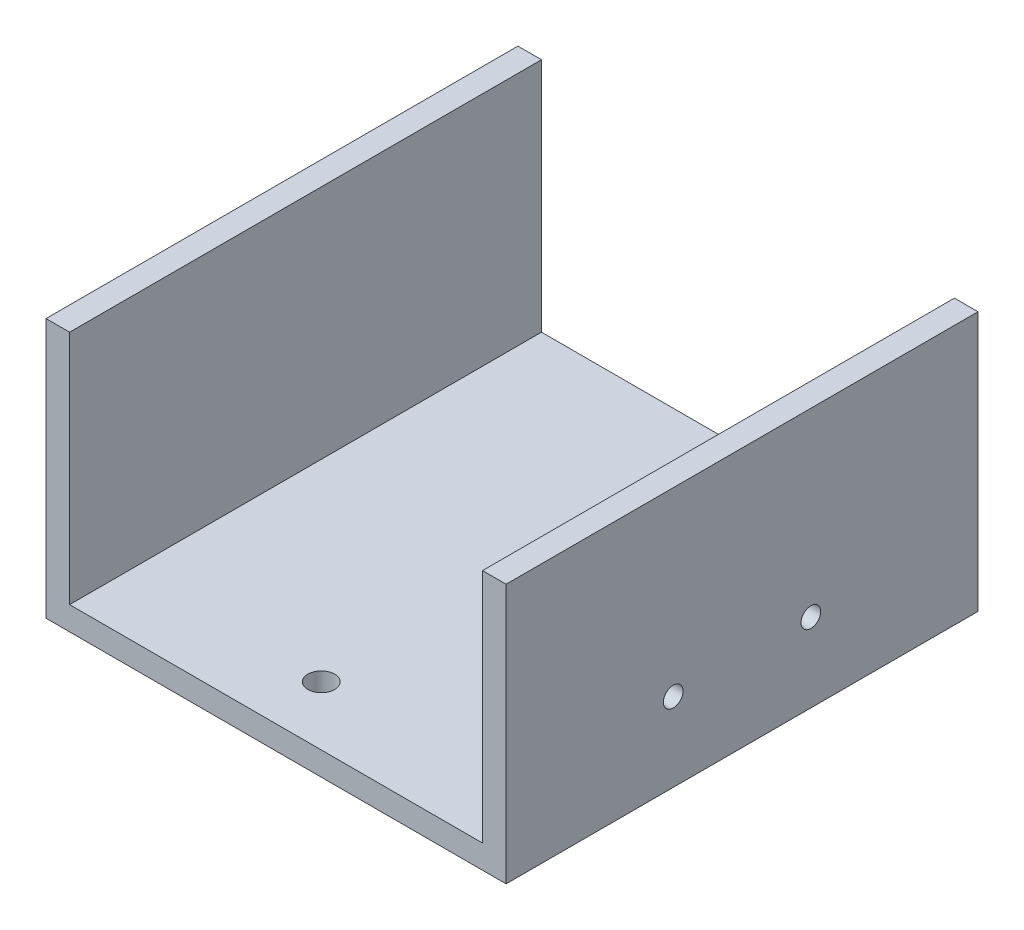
from build123d import *

# Parameters (mm, degrees)
EXTRUSION1_DEPTH      = 120
TROU_TARAUD_M82_D     = 6.8
TROU_TARAUD_M82_DEPTH = 22.25
TROU_TARAUD_M82_TIP   = 2.042926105
TROU_TARAUD_M61_D     = 5
TROU_TARAUD_M61_DEPTH = 17
TROU_TARAUD_M61_TIP   = 1.502151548


with BuildPart() as part:
    # Esquisse1 → Extrusion1 (new body)
    with BuildSketch(Plane.XY):
        Polygon((-52.5, -27), (52.5, -27), (52.5, 33), (58.5, 33), (58.5, -33), (-58.5, -33), (-58.5, 33), (-52.5, 33), align=None)
    extrude(amount=EXTRUSION1_DEPTH)

    # Trou taraud_ M82
    with Locations(Plane.XZ.offset(33)):
        with Locations((46.5, 15), (-3.5, 15), (46.5, 105), (-3.5, 105)):
            Hole(TROU_TARAUD_M82_D / 2, depth=TROU_TARAUD_M82_DEPTH)
            with Locations((0, 0, -(TROU_TARAUD_M82_DEPTH + TROU_TARAUD_M82_TIP / 2))):  # 118° drill point
                Cone(0, TROU_TARAUD_M82_D / 2, TROU_TARAUD_M82_TIP, mode=Mode.SUBTRACT)

    # Trou taraud_ M61
    with Locations(Plane(origin=(58.5, 0, 0), x_dir=(0, 0, -1), z_dir=(1, 0, 0))):
        with Locations((-42.5, -13), (-77.5, -13)):
            Hole(TROU_TARAUD_M61_D / 2, depth=TROU_TARAUD_M61_DEPTH)
            with Locations((0, 0, -(TROU_TARAUD_M61_DEPTH + TROU_TARAUD_M61_TIP / 2))):  # 118° drill point
                Cone(0, TROU_TARAUD_M61_D / 2, TROU_TARAUD_M61_TIP, mode=Mode.SUBTRACT)


solid = part.part
